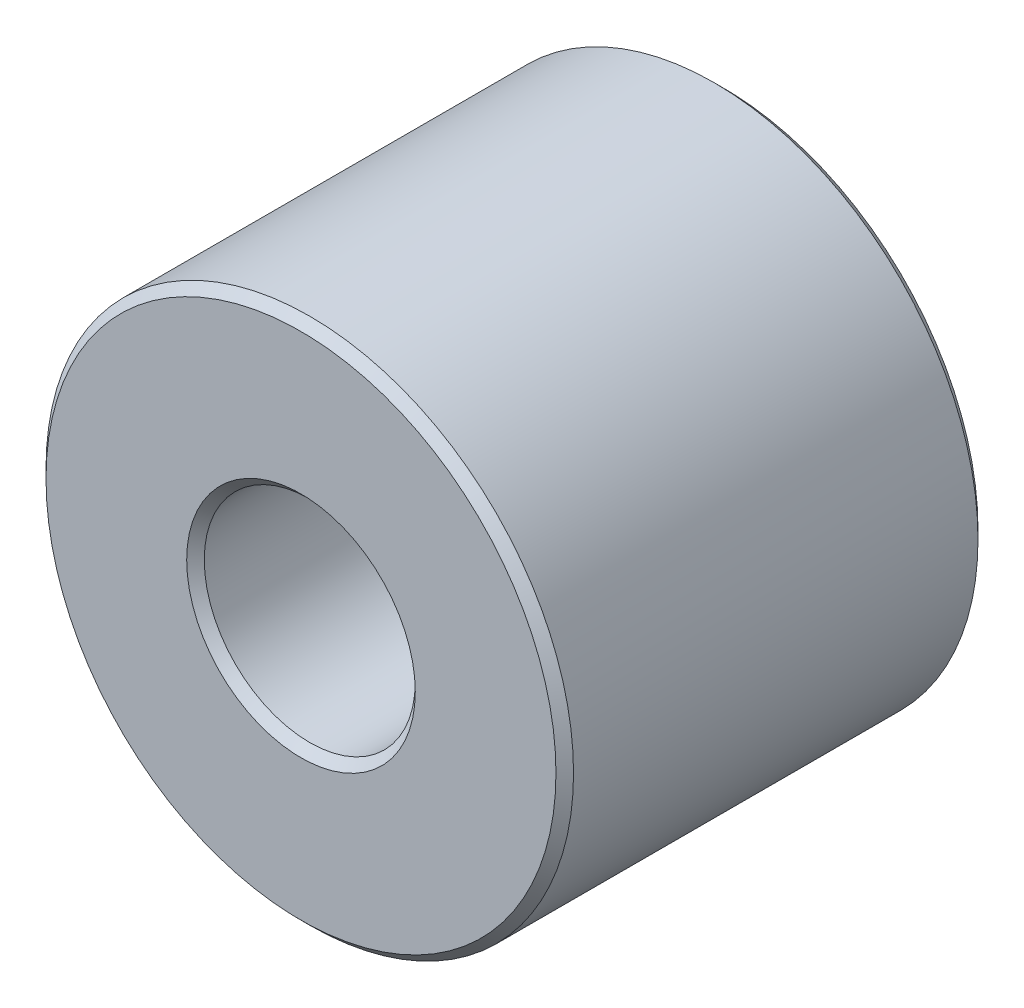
from build123d import *

# Parameters (mm, degrees)
SKETCH_1_R      = 7.5
SKETCH_1_R_2    = 3
EXTRUDE_1_DEPTH = 12
CHAMFER_1_SIZE  = 0.25


with BuildPart() as part:
    # Sketch 1 → Extrude 1 (new body)
    with BuildSketch(Plane.XY):
        Circle(SKETCH_1_R)
        Circle(SKETCH_1_R_2, mode=Mode.SUBTRACT)
    extrude(amount=EXTRUDE_1_DEPTH)

    # Chamfer 1
    chamfer_1_edges = [part.edges().sort_by_distance(p)[0] for p in [
        (-7.5, 0, 0),
        (-7.5, 0, 12),
        (-3, 0, 0),
        (-3, 0, 12),
    ]]
    chamfer(chamfer_1_edges, length=CHAMFER_1_SIZE)


solid = part.part
